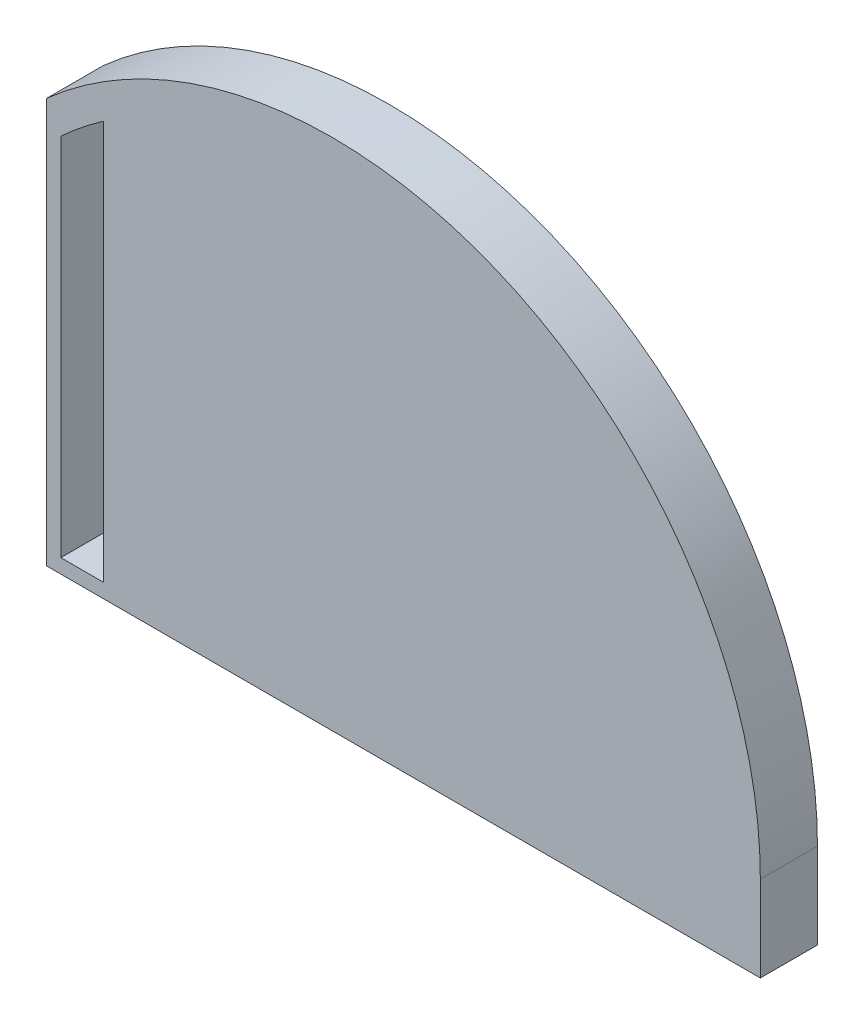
ISO-10303-21;
HEADER;
FILE_DESCRIPTION(('STEP AP214'),'2;1');
FILE_NAME('part.step','',(''),(''),'','','');
FILE_SCHEMA(('AUTOMOTIVE_DESIGN { 1 0 10303 214 1 1 1 1 }'));
ENDSEC;
DATA;
#1=APPLICATION_CONTEXT('core data for automotive mechanical design processes');
#2=APPLICATION_PROTOCOL_DEFINITION('international standard','automotive_design',2000,#1);
#3=PRODUCT_CONTEXT('',#1,'mechanical');
#4=PRODUCT('Part','Part','',(#3));
#5=PRODUCT_RELATED_PRODUCT_CATEGORY('part','',(#4));
#6=PRODUCT_DEFINITION_FORMATION('','',#4);
#7=PRODUCT_DEFINITION_CONTEXT('part definition',#1,'design');
#8=PRODUCT_DEFINITION('design','',#6,#7);
#9=PRODUCT_DEFINITION_SHAPE('','',#8);
#10=(LENGTH_UNIT() NAMED_UNIT(*) SI_UNIT(.MILLI.,.METRE.));
#11=(NAMED_UNIT(*) PLANE_ANGLE_UNIT() SI_UNIT($,.RADIAN.));
#12=(NAMED_UNIT(*) SI_UNIT($,.STERADIAN.) SOLID_ANGLE_UNIT());
#13=UNCERTAINTY_MEASURE_WITH_UNIT(LENGTH_MEASURE(1.E-05),#10,'distance_accuracy_value','');
#14=(GEOMETRIC_REPRESENTATION_CONTEXT(3) GLOBAL_UNCERTAINTY_ASSIGNED_CONTEXT((#13)) GLOBAL_UNIT_ASSIGNED_CONTEXT((#10,
#11,#12)) REPRESENTATION_CONTEXT('',''));
#15=CARTESIAN_POINT('',(0.,0.,0.));
#16=DIRECTION('',(0.,0.,1.));
#17=DIRECTION('',(1.,0.,0.));
#18=AXIS2_PLACEMENT_3D('',#15,#16,#17);
#19=CARTESIAN_POINT('',(0.,141.803398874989,20.));
#20=DIRECTION('',(1.,0.,0.));
#21=DIRECTION('',(0.,1.,0.));
#22=AXIS2_PLACEMENT_3D('',#19,#20,#21);
#23=PLANE('',#22);
#24=DIRECTION('',(0.,-1.,0.));
#25=VECTOR('',#24,1.);
#26=CARTESIAN_POINT('',(0.,141.803398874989,0.));
#27=LINE('',#26,#25);
#28=CARTESIAN_POINT('',(0.,141.803398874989,0.));
#29=VERTEX_POINT('',#28);
#30=CARTESIAN_POINT('',(0.,0.,0.));
#31=VERTEX_POINT('',#30);
#32=EDGE_CURVE('E130',#29,#31,#27,.T.);
#33=ORIENTED_EDGE('',*,*,#32,.T.);
#34=DIRECTION('',(0.,0.,-1.));
#35=VECTOR('',#34,1.);
#36=CARTESIAN_POINT('',(0.,0.,20.));
#37=LINE('',#36,#35);
#38=CARTESIAN_POINT('',(0.,0.,20.));
#39=VERTEX_POINT('',#38);
#40=EDGE_CURVE('E11',#39,#31,#37,.T.);
#41=ORIENTED_EDGE('',*,*,#40,.F.);
#42=DIRECTION('',(0.,-1.,0.));
#43=VECTOR('',#42,1.);
#44=CARTESIAN_POINT('',(0.,141.803398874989,20.));
#45=LINE('',#44,#43);
#46=CARTESIAN_POINT('',(0.,141.803398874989,20.));
#47=VERTEX_POINT('',#46);
#48=EDGE_CURVE('E141',#47,#39,#45,.T.);
#49=ORIENTED_EDGE('',*,*,#48,.F.);
#50=DIRECTION('',(0.,0.,-1.));
#51=VECTOR('',#50,1.);
#52=CARTESIAN_POINT('',(0.,141.803398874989,20.));
#53=LINE('',#52,#51);
#54=EDGE_CURVE('E150',#47,#29,#53,.T.);
#55=ORIENTED_EDGE('',*,*,#54,.T.);
#56=EDGE_LOOP('',(#33,#41,#49,#55));
#57=FACE_BOUND('',#56,.T.);
#58=ADVANCED_FACE('F32',(#57),#23,.F.);
#59=CARTESIAN_POINT('',(0.,0.,20.));
#60=DIRECTION('',(0.,1.,0.));
#61=DIRECTION('',(0.,0.,1.));
#62=AXIS2_PLACEMENT_3D('',#59,#60,#61);
#63=PLANE('',#62);
#64=DIRECTION('',(1.,0.,0.));
#65=VECTOR('',#64,1.);
#66=CARTESIAN_POINT('',(0.,0.,0.));
#67=LINE('',#66,#65);
#68=CARTESIAN_POINT('',(250.,0.,0.));
#69=VERTEX_POINT('',#68);
#70=EDGE_CURVE('E135',#31,#69,#67,.T.);
#71=ORIENTED_EDGE('',*,*,#70,.T.);
#72=DIRECTION('',(0.,0.,-1.));
#73=VECTOR('',#72,1.);
#74=CARTESIAN_POINT('',(250.,0.,20.));
#75=LINE('',#74,#73);
#76=CARTESIAN_POINT('',(250.,0.,20.));
#77=VERTEX_POINT('',#76);
#78=EDGE_CURVE('E39',#77,#69,#75,.T.);
#79=ORIENTED_EDGE('',*,*,#78,.F.);
#80=DIRECTION('',(1.,0.,0.));
#81=VECTOR('',#80,1.);
#82=CARTESIAN_POINT('',(0.,0.,20.));
#83=LINE('',#82,#81);
#84=EDGE_CURVE('E144',#39,#77,#83,.T.);
#85=ORIENTED_EDGE('',*,*,#84,.F.);
#86=ORIENTED_EDGE('',*,*,#40,.T.);
#87=EDGE_LOOP('',(#71,#79,#85,#86));
#88=FACE_BOUND('',#87,.T.);
#89=ADVANCED_FACE('F174',(#88),#63,.F.);
#90=CARTESIAN_POINT('',(250.,0.,20.));
#91=DIRECTION('',(-1.,0.,0.));
#92=DIRECTION('',(0.,0.,1.));
#93=AXIS2_PLACEMENT_3D('',#90,#91,#92);
#94=PLANE('',#93);
#95=DIRECTION('',(0.,1.,0.));
#96=VECTOR('',#95,1.);
#97=CARTESIAN_POINT('',(250.,0.,0.));
#98=LINE('',#97,#96);
#99=CARTESIAN_POINT('',(250.,30.,0.));
#100=VERTEX_POINT('',#99);
#101=EDGE_CURVE('E137',#69,#100,#98,.T.);
#102=ORIENTED_EDGE('',*,*,#101,.T.);
#103=DIRECTION('',(0.,0.,-1.));
#104=VECTOR('',#103,1.);
#105=CARTESIAN_POINT('',(250.,30.,20.));
#106=LINE('',#105,#104);
#107=CARTESIAN_POINT('',(250.,30.,20.));
#108=VERTEX_POINT('',#107);
#109=EDGE_CURVE('E153',#108,#100,#106,.T.);
#110=ORIENTED_EDGE('',*,*,#109,.F.);
#111=DIRECTION('',(0.,1.,0.));
#112=VECTOR('',#111,1.);
#113=CARTESIAN_POINT('',(250.,0.,20.));
#114=LINE('',#113,#112);
#115=EDGE_CURVE('E146',#77,#108,#114,.T.);
#116=ORIENTED_EDGE('',*,*,#115,.F.);
#117=ORIENTED_EDGE('',*,*,#78,.T.);
#118=EDGE_LOOP('',(#102,#110,#116,#117));
#119=FACE_BOUND('',#118,.T.);
#120=ADVANCED_FACE('F160',(#119),#94,.F.);
#121=CARTESIAN_POINT('',(100.,30.,20.));
#122=DIRECTION('',(0.,0.,-1.));
#123=DIRECTION('',(-1.,0.,0.));
#124=AXIS2_PLACEMENT_3D('',#121,#122,#123);
#125=CYLINDRICAL_SURFACE('',#124,150.);
#126=CARTESIAN_POINT('',(100.,30.,0.));
#127=DIRECTION('',(0.,0.,1.));
#128=DIRECTION('',(1.,0.,0.));
#129=AXIS2_PLACEMENT_3D('',#126,#127,#128);
#130=CIRCLE('',#129,150.);
#131=EDGE_CURVE('E139',#100,#29,#130,.T.);
#132=ORIENTED_EDGE('',*,*,#131,.T.);
#133=ORIENTED_EDGE('',*,*,#54,.F.);
#134=CARTESIAN_POINT('',(100.,30.,20.));
#135=DIRECTION('',(0.,0.,1.));
#136=DIRECTION('',(1.,0.,0.));
#137=AXIS2_PLACEMENT_3D('',#134,#135,#136);
#138=CIRCLE('',#137,150.);
#139=EDGE_CURVE('E148',#108,#47,#138,.T.);
#140=ORIENTED_EDGE('',*,*,#139,.F.);
#141=ORIENTED_EDGE('',*,*,#109,.T.);
#142=EDGE_LOOP('',(#132,#133,#140,#141));
#143=FACE_BOUND('',#142,.T.);
#144=ADVANCED_FACE('F169',(#143),#125,.T.);
#145=CARTESIAN_POINT('',(100.,30.,20.));
#146=DIRECTION('',(0.,0.,1.));
#147=DIRECTION('',(1.,0.,0.));
#148=AXIS2_PLACEMENT_3D('',#145,#146,#147);
#149=PLANE('',#148);
#150=DIRECTION('',(1.,0.,0.));
#151=VECTOR('',#150,1.);
#152=CARTESIAN_POINT('',(5.00000000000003,5.,20.));
#153=LINE('',#152,#151);
#154=CARTESIAN_POINT('',(5.00000000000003,5.,20.));
#155=VERTEX_POINT('',#154);
#156=CARTESIAN_POINT('',(20.,5.,20.));
#157=VERTEX_POINT('',#156);
#158=EDGE_CURVE('E46',#155,#157,#153,.T.);
#159=ORIENTED_EDGE('',*,*,#158,.F.);
#160=DIRECTION('',(0.,-1.,0.));
#161=VECTOR('',#160,1.);
#162=CARTESIAN_POINT('',(4.99999999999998,132.834819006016,20.));
#163=LINE('',#162,#161);
#164=CARTESIAN_POINT('',(4.99999999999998,132.834819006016,20.));
#165=VERTEX_POINT('',#164);
#166=EDGE_CURVE('E114',#165,#155,#163,.T.);
#167=ORIENTED_EDGE('',*,*,#166,.F.);
#168=CARTESIAN_POINT('',(100.,30.,20.));
#169=DIRECTION('',(0.,0.,1.));
#170=DIRECTION('',(1.,0.,0.));
#171=AXIS2_PLACEMENT_3D('',#168,#169,#170);
#172=CIRCLE('',#171,140.);
#173=CARTESIAN_POINT('',(20.,144.891252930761,20.));
#174=VERTEX_POINT('',#173);
#175=EDGE_CURVE('E98',#174,#165,#172,.T.);
#176=ORIENTED_EDGE('',*,*,#175,.F.);
#177=DIRECTION('',(0.,1.,0.));
#178=VECTOR('',#177,1.);
#179=CARTESIAN_POINT('',(20.,5.,20.));
#180=LINE('',#179,#178);
#181=EDGE_CURVE('E107',#157,#174,#180,.T.);
#182=ORIENTED_EDGE('',*,*,#181,.F.);
#183=EDGE_LOOP('',(#159,#167,#176,#182));
#184=FACE_BOUND('',#183,.T.);
#185=ORIENTED_EDGE('',*,*,#48,.T.);
#186=ORIENTED_EDGE('',*,*,#84,.T.);
#187=ORIENTED_EDGE('',*,*,#115,.T.);
#188=ORIENTED_EDGE('',*,*,#139,.T.);
#189=EDGE_LOOP('',(#185,#186,#187,#188));
#190=FACE_BOUND('',#189,.T.);
#191=ADVANCED_FACE('F111',(#184,#190),#149,.T.);
#192=CARTESIAN_POINT('',(100.,30.,0.));
#193=DIRECTION('',(0.,0.,1.));
#194=DIRECTION('',(1.,0.,0.));
#195=AXIS2_PLACEMENT_3D('',#192,#193,#194);
#196=PLANE('',#195);
#197=DIRECTION('',(0.,-1.,0.));
#198=VECTOR('',#197,1.);
#199=CARTESIAN_POINT('',(4.99999999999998,132.834819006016,0.));
#200=LINE('',#199,#198);
#201=CARTESIAN_POINT('',(4.99999999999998,132.834819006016,0.));
#202=VERTEX_POINT('',#201);
#203=CARTESIAN_POINT('',(5.00000000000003,5.,0.));
#204=VERTEX_POINT('',#203);
#205=EDGE_CURVE('E125',#202,#204,#200,.T.);
#206=ORIENTED_EDGE('',*,*,#205,.T.);
#207=DIRECTION('',(1.,0.,0.));
#208=VECTOR('',#207,1.);
#209=CARTESIAN_POINT('',(5.00000000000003,5.,0.));
#210=LINE('',#209,#208);
#211=CARTESIAN_POINT('',(20.,5.,0.));
#212=VERTEX_POINT('',#211);
#213=EDGE_CURVE('E116',#204,#212,#210,.T.);
#214=ORIENTED_EDGE('',*,*,#213,.T.);
#215=DIRECTION('',(0.,1.,0.));
#216=VECTOR('',#215,1.);
#217=CARTESIAN_POINT('',(20.,5.,0.));
#218=LINE('',#217,#216);
#219=CARTESIAN_POINT('',(20.,144.891252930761,0.));
#220=VERTEX_POINT('',#219);
#221=EDGE_CURVE('E122',#212,#220,#218,.T.);
#222=ORIENTED_EDGE('',*,*,#221,.T.);
#223=CARTESIAN_POINT('',(100.,30.,0.));
#224=DIRECTION('',(0.,0.,1.));
#225=DIRECTION('',(1.,0.,0.));
#226=AXIS2_PLACEMENT_3D('',#223,#224,#225);
#227=CIRCLE('',#226,140.);
#228=EDGE_CURVE('E54',#220,#202,#227,.T.);
#229=ORIENTED_EDGE('',*,*,#228,.T.);
#230=EDGE_LOOP('',(#206,#214,#222,#229));
#231=FACE_BOUND('',#230,.T.);
#232=ORIENTED_EDGE('',*,*,#32,.F.);
#233=ORIENTED_EDGE('',*,*,#131,.F.);
#234=ORIENTED_EDGE('',*,*,#101,.F.);
#235=ORIENTED_EDGE('',*,*,#70,.F.);
#236=EDGE_LOOP('',(#232,#233,#234,#235));
#237=FACE_BOUND('',#236,.T.);
#238=ADVANCED_FACE('F166',(#231,#237),#196,.F.);
#239=CARTESIAN_POINT('',(5.00000000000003,5.,0.));
#240=DIRECTION('',(0.,-1.,0.));
#241=DIRECTION('',(0.,0.,-1.));
#242=AXIS2_PLACEMENT_3D('',#239,#240,#241);
#243=PLANE('',#242);
#244=ORIENTED_EDGE('',*,*,#158,.T.);
#245=DIRECTION('',(0.,0.,1.));
#246=VECTOR('',#245,1.);
#247=CARTESIAN_POINT('',(20.,5.,0.));
#248=LINE('',#247,#246);
#249=EDGE_CURVE('E104',#212,#157,#248,.T.);
#250=ORIENTED_EDGE('',*,*,#249,.F.);
#251=ORIENTED_EDGE('',*,*,#213,.F.);
#252=DIRECTION('',(0.,0.,1.));
#253=VECTOR('',#252,1.);
#254=CARTESIAN_POINT('',(5.00000000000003,5.,0.));
#255=LINE('',#254,#253);
#256=EDGE_CURVE('E128',#204,#155,#255,.T.);
#257=ORIENTED_EDGE('',*,*,#256,.T.);
#258=EDGE_LOOP('',(#244,#250,#251,#257));
#259=FACE_BOUND('',#258,.T.);
#260=ADVANCED_FACE('F188',(#259),#243,.F.);
#261=CARTESIAN_POINT('',(4.99999999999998,132.834819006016,0.));
#262=DIRECTION('',(-1.,0.,0.));
#263=DIRECTION('',(0.,-1.,0.));
#264=AXIS2_PLACEMENT_3D('',#261,#262,#263);
#265=PLANE('',#264);
#266=ORIENTED_EDGE('',*,*,#166,.T.);
#267=ORIENTED_EDGE('',*,*,#256,.F.);
#268=ORIENTED_EDGE('',*,*,#205,.F.);
#269=DIRECTION('',(0.,0.,1.));
#270=VECTOR('',#269,1.);
#271=CARTESIAN_POINT('',(4.99999999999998,132.834819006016,0.));
#272=LINE('',#271,#270);
#273=EDGE_CURVE('E103',#202,#165,#272,.T.);
#274=ORIENTED_EDGE('',*,*,#273,.T.);
#275=EDGE_LOOP('',(#266,#267,#268,#274));
#276=FACE_BOUND('',#275,.T.);
#277=ADVANCED_FACE('F192',(#276),#265,.F.);
#278=CARTESIAN_POINT('',(100.,30.,0.));
#279=DIRECTION('',(0.,0.,1.));
#280=DIRECTION('',(1.,0.,0.));
#281=AXIS2_PLACEMENT_3D('',#278,#279,#280);
#282=CYLINDRICAL_SURFACE('',#281,140.);
#283=ORIENTED_EDGE('',*,*,#175,.T.);
#284=ORIENTED_EDGE('',*,*,#273,.F.);
#285=ORIENTED_EDGE('',*,*,#228,.F.);
#286=DIRECTION('',(0.,0.,1.));
#287=VECTOR('',#286,1.);
#288=CARTESIAN_POINT('',(20.,144.891252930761,0.));
#289=LINE('',#288,#287);
#290=EDGE_CURVE('E94',#220,#174,#289,.T.);
#291=ORIENTED_EDGE('',*,*,#290,.T.);
#292=EDGE_LOOP('',(#283,#284,#285,#291));
#293=FACE_BOUND('',#292,.T.);
#294=ADVANCED_FACE('F96',(#293),#282,.F.);
#295=CARTESIAN_POINT('',(20.,5.,0.));
#296=DIRECTION('',(1.,0.,0.));
#297=DIRECTION('',(0.,1.,0.));
#298=AXIS2_PLACEMENT_3D('',#295,#296,#297);
#299=PLANE('',#298);
#300=ORIENTED_EDGE('',*,*,#181,.T.);
#301=ORIENTED_EDGE('',*,*,#290,.F.);
#302=ORIENTED_EDGE('',*,*,#221,.F.);
#303=ORIENTED_EDGE('',*,*,#249,.T.);
#304=EDGE_LOOP('',(#300,#301,#302,#303));
#305=FACE_BOUND('',#304,.T.);
#306=ADVANCED_FACE('F108',(#305),#299,.F.);
#307=CLOSED_SHELL('',(#58,#89,#120,#144,#191,#238,#260,#277,#294,#306));
#308=MANIFOLD_SOLID_BREP('B2',#307);
#309=ADVANCED_BREP_SHAPE_REPRESENTATION('',(#18,#308),#14);
#310=SHAPE_DEFINITION_REPRESENTATION(#9,#309);
ENDSEC;
END-ISO-10303-21;
